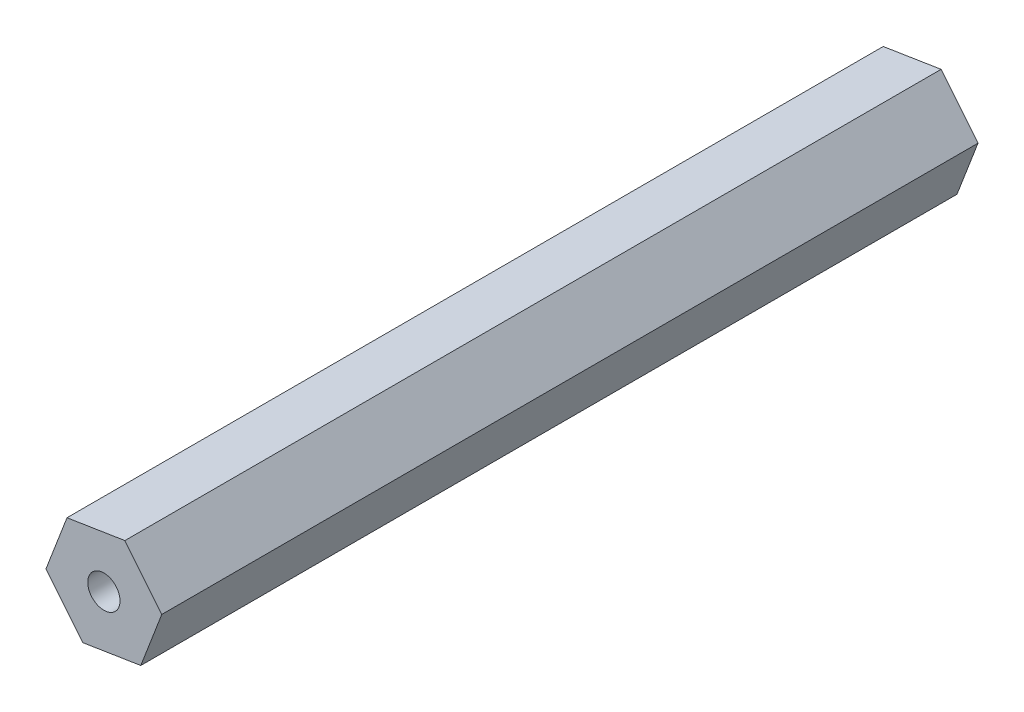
from build123d import *

# Parameters (mm, degrees)
BOSS_EXTRUDE1_DEPTH            = 102.108
TAP_DRILL_FOR_10_32_TAP3_D     = 4.0386
TAP_DRILL_FOR_10_32_TAP3_DEPTH = 12.7
TAP_DRILL_FOR_10_32_TAP3_TIP   = 1.213317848


with BuildPart() as part:
    # Sketch1 → Boss-Extrude1 (new body)
    with BuildSketch(Plane.XY):
        Polygon((2.626799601, 6.845674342), (-4.615128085, 5.697712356), (-7.241927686, -1.147961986), (-2.626799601, -6.845674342), (4.615128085, -5.697712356), (7.241927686, 1.147961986), align=None)
    extrude(amount=BOSS_EXTRUDE1_DEPTH)

    # Sketch9 → Tap Drill for _10-32 Tap2 (revolve, cut)
    with BuildSketch(Plane(origin=(0, 0, 102.108), x_dir=(0, -1, 0), z_dir=(1, 0, 0))):
        Polygon((0, 0), (0, 13.913317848), (2.0193, 12.7), (2.0193, 0), align=None)
    revolve(axis=Axis((0, 0, 108.458), (0, 0, -1)), mode=Mode.SUBTRACT)

    # Tap Drill for _10-32 Tap3
    with Locations(Plane(origin=(0, 0, 0), x_dir=(-1, 0, 0), z_dir=(0, 0, -1))):
        with Locations((0, 0)):
            Hole(TAP_DRILL_FOR_10_32_TAP3_D / 2, depth=TAP_DRILL_FOR_10_32_TAP3_DEPTH)
            with Locations((0, 0, -(TAP_DRILL_FOR_10_32_TAP3_DEPTH + TAP_DRILL_FOR_10_32_TAP3_TIP / 2))):  # 118° drill point
                Cone(0, TAP_DRILL_FOR_10_32_TAP3_D / 2, TAP_DRILL_FOR_10_32_TAP3_TIP, mode=Mode.SUBTRACT)


solid = part.part
